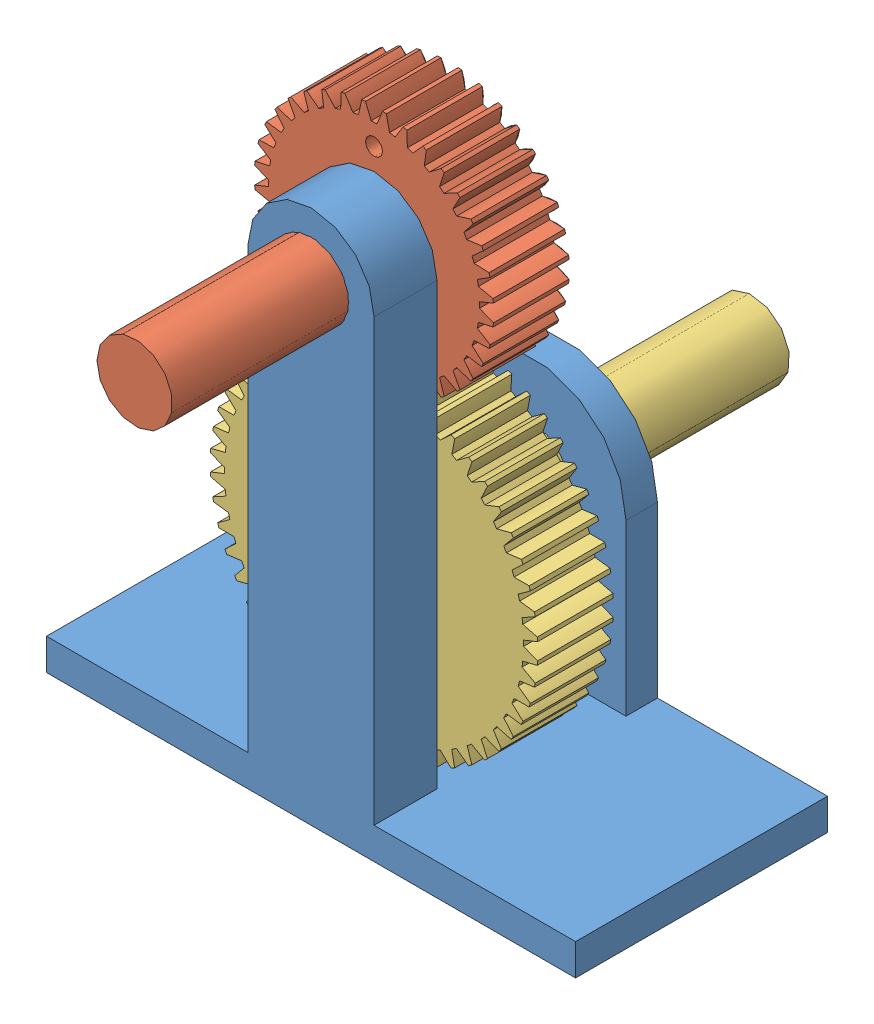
SolidWorks assembly ReducteurExt-cor.SLDASM, configuration Défaut (file format 6000). Lengths in mm.
Overall size (84 93.86 98).
3 component instances, 3 part files, 4 mates.
Components (placement in the parent):
- bati1-1: bati1.SLDPRT [Défaut] at (-10.5991 2.8059 0) size (84 84.91 40)
- pignon1(36)-1: pignon1(36).SLDPRT [Défaut] at (-10.5991 2.8059 0) x (0 0 -1) z (1 0 0) size (50 37.9 37.9)
- pignon2(50)-1: pignon2(50).SLDPRT [Metric - Spur gear 1M 50T 20PA 12FW ---S50N75H50L0.8N] at (-10.5991 -40.1941 -12) x (0 0 1) z (-0.982351 -0.187044 0) size (60 51.93 52)
Mates (geometry in assembly coordinates):
- Coaxiale1: concentric aligned: cylinder of pignon1(36)-1 through (-10.5991 2.8059 38) axis (0 0 -1) radius 6; cylinder of bati1-1 through (-10.5991 2.8059 10) axis (0 0 -1) radius 6
- Coïncidente1: coincident anti-aligned: plane of bati1-1 through (-10.5991 2.8059 0) normal (0 0 -1); plane of pignon1(36)-1 through (-10.5991 2.8059 0) normal (0 0 1)
- Coaxiale2: concentric anti-aligned: cylinder of bati1-1 through (-10.5991 -40.1941 30.6839) axis (0 0 -1) radius 6; cylinder of pignon2(50)-1 through (-10.5991 -40.1941 -60) axis (0 0 1) radius 6
- Coïncidente2: coincident anti-aligned: plane of bati1-1 through (-10.5991 2.8059 0) normal (0 0 -1); plane of pignon2(50)-1 through (-10.5991 -40.1941 0) normal (0 0 1)
